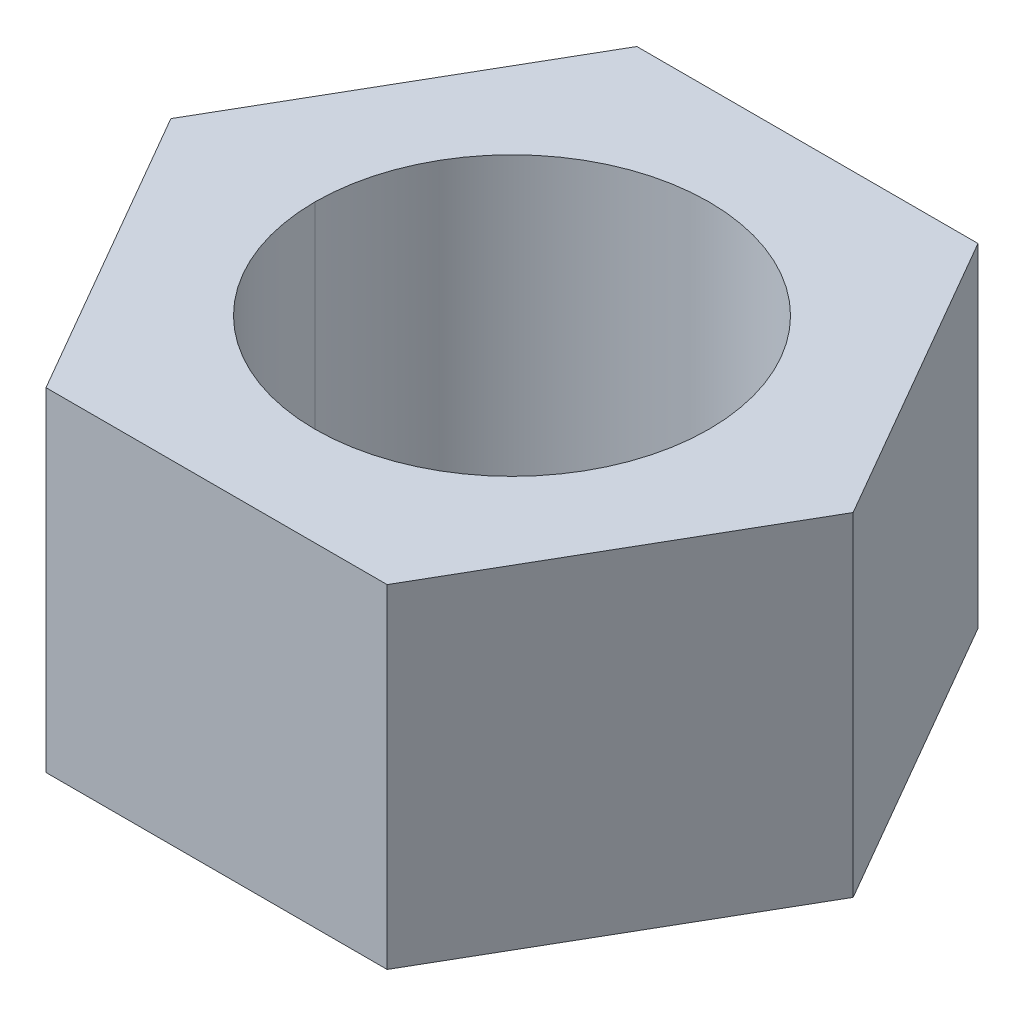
ISO-10303-21;
HEADER;
FILE_DESCRIPTION(('STEP AP214'),'2;1');
FILE_NAME('part.step','',(''),(''),'','','');
FILE_SCHEMA(('AUTOMOTIVE_DESIGN { 1 0 10303 214 1 1 1 1 }'));
ENDSEC;
DATA;
#1=APPLICATION_CONTEXT('core data for automotive mechanical design processes');
#2=APPLICATION_PROTOCOL_DEFINITION('international standard','automotive_design',2000,#1);
#3=PRODUCT_CONTEXT('',#1,'mechanical');
#4=PRODUCT('Part','Part','',(#3));
#5=PRODUCT_RELATED_PRODUCT_CATEGORY('part','',(#4));
#6=PRODUCT_DEFINITION_FORMATION('','',#4);
#7=PRODUCT_DEFINITION_CONTEXT('part definition',#1,'design');
#8=PRODUCT_DEFINITION('design','',#6,#7);
#9=PRODUCT_DEFINITION_SHAPE('','',#8);
#10=(LENGTH_UNIT() NAMED_UNIT(*) SI_UNIT(.MILLI.,.METRE.));
#11=(NAMED_UNIT(*) PLANE_ANGLE_UNIT() SI_UNIT($,.RADIAN.));
#12=(NAMED_UNIT(*) SI_UNIT($,.STERADIAN.) SOLID_ANGLE_UNIT());
#13=UNCERTAINTY_MEASURE_WITH_UNIT(LENGTH_MEASURE(1.E-05),#10,'distance_accuracy_value','');
#14=(GEOMETRIC_REPRESENTATION_CONTEXT(3) GLOBAL_UNCERTAINTY_ASSIGNED_CONTEXT((#13)) GLOBAL_UNIT_ASSIGNED_CONTEXT((#10,
#11,#12)) REPRESENTATION_CONTEXT('',''));
#15=CARTESIAN_POINT('',(0.,0.,0.));
#16=DIRECTION('',(0.,0.,1.));
#17=DIRECTION('',(1.,0.,0.));
#18=AXIS2_PLACEMENT_3D('',#15,#16,#17);
#19=CARTESIAN_POINT('',(10.9985226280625,10.7461538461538,19.05));
#20=DIRECTION('',(0.866025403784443,0.,0.499999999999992));
#21=DIRECTION('',(0.499999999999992,0.,-0.866025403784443));
#22=AXIS2_PLACEMENT_3D('',#19,#20,#21);
#23=PLANE('',#22);
#24=DIRECTION('',(0.499999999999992,0.,-0.866025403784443));
#25=VECTOR('',#24,1.);
#26=CARTESIAN_POINT('',(10.9985226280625,10.7461538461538,19.05));
#27=LINE('',#26,#25);
#28=CARTESIAN_POINT('',(10.9985226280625,10.7461538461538,19.05));
#29=VERTEX_POINT('',#28);
#30=CARTESIAN_POINT('',(21.9970452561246,10.7461538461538,0.));
#31=VERTEX_POINT('',#30);
#32=EDGE_CURVE('E125',#29,#31,#27,.T.);
#33=ORIENTED_EDGE('',*,*,#32,.F.);
#34=DIRECTION('',(0.,1.,0.));
#35=VECTOR('',#34,1.);
#36=CARTESIAN_POINT('',(10.9985226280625,10.7461538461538,19.05));
#37=LINE('',#36,#35);
#38=CARTESIAN_POINT('',(10.9985226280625,-10.7461538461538,19.05));
#39=VERTEX_POINT('',#38);
#40=EDGE_CURVE('E88',#39,#29,#37,.T.);
#41=ORIENTED_EDGE('',*,*,#40,.F.);
#42=DIRECTION('',(0.499999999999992,0.,-0.866025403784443));
#43=VECTOR('',#42,1.);
#44=CARTESIAN_POINT('',(10.9985226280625,-10.7461538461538,19.05));
#45=LINE('',#44,#43);
#46=CARTESIAN_POINT('',(21.9970452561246,-10.7461538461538,0.));
#47=VERTEX_POINT('',#46);
#48=EDGE_CURVE('E99',#39,#47,#45,.T.);
#49=ORIENTED_EDGE('',*,*,#48,.T.);
#50=DIRECTION('',(0.,1.,0.));
#51=VECTOR('',#50,1.);
#52=CARTESIAN_POINT('',(21.9970452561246,10.7461538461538,0.));
#53=LINE('',#52,#51);
#54=EDGE_CURVE('E135',#31,#47,#53,.F.);
#55=ORIENTED_EDGE('',*,*,#54,.F.);
#56=EDGE_LOOP('',(#33,#41,#49,#55));
#57=FACE_BOUND('',#56,.T.);
#58=ADVANCED_FACE('F16',(#57),#23,.T.);
#59=CARTESIAN_POINT('',(21.9970452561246,10.7461538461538,0.));
#60=DIRECTION('',(0.866025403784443,0.,-0.499999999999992));
#61=DIRECTION('',(-0.499999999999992,0.,-0.866025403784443));
#62=AXIS2_PLACEMENT_3D('',#59,#60,#61);
#63=PLANE('',#62);
#64=DIRECTION('',(-0.499999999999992,0.,-0.866025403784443));
#65=VECTOR('',#64,1.);
#66=CARTESIAN_POINT('',(21.9970452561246,10.7461538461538,0.));
#67=LINE('',#66,#65);
#68=CARTESIAN_POINT('',(10.9985226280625,10.7461538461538,-19.05));
#69=VERTEX_POINT('',#68);
#70=EDGE_CURVE('E123',#31,#69,#67,.T.);
#71=ORIENTED_EDGE('',*,*,#70,.F.);
#72=ORIENTED_EDGE('',*,*,#54,.T.);
#73=DIRECTION('',(-0.499999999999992,0.,-0.866025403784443));
#74=VECTOR('',#73,1.);
#75=CARTESIAN_POINT('',(21.9970452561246,-10.7461538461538,0.));
#76=LINE('',#75,#74);
#77=CARTESIAN_POINT('',(10.9985226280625,-10.7461538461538,-19.05));
#78=VERTEX_POINT('',#77);
#79=EDGE_CURVE('E111',#47,#78,#76,.T.);
#80=ORIENTED_EDGE('',*,*,#79,.T.);
#81=DIRECTION('',(0.,1.,0.));
#82=VECTOR('',#81,1.);
#83=CARTESIAN_POINT('',(10.9985226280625,10.7461538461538,-19.05));
#84=LINE('',#83,#82);
#85=EDGE_CURVE('E133',#69,#78,#84,.F.);
#86=ORIENTED_EDGE('',*,*,#85,.F.);
#87=EDGE_LOOP('',(#71,#72,#80,#86));
#88=FACE_BOUND('',#87,.T.);
#89=ADVANCED_FACE('F172',(#88),#63,.T.);
#90=CARTESIAN_POINT('',(10.9985226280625,10.7461538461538,-19.05));
#91=DIRECTION('',(0.,0.,-1.));
#92=DIRECTION('',(-1.,0.,0.));
#93=AXIS2_PLACEMENT_3D('',#90,#91,#92);
#94=PLANE('',#93);
#95=DIRECTION('',(1.,0.,0.));
#96=VECTOR('',#95,1.);
#97=CARTESIAN_POINT('',(0.,10.7461538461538,-19.05));
#98=LINE('',#97,#96);
#99=CARTESIAN_POINT('',(-10.9985226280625,10.7461538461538,-19.05));
#100=VERTEX_POINT('',#99);
#101=EDGE_CURVE('E121',#69,#100,#98,.F.);
#102=ORIENTED_EDGE('',*,*,#101,.F.);
#103=ORIENTED_EDGE('',*,*,#85,.T.);
#104=DIRECTION('',(1.,0.,0.));
#105=VECTOR('',#104,1.);
#106=CARTESIAN_POINT('',(-10.9985226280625,-10.7461538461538,-19.05));
#107=LINE('',#106,#105);
#108=CARTESIAN_POINT('',(-10.9985226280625,-10.7461538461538,-19.05));
#109=VERTEX_POINT('',#108);
#110=EDGE_CURVE('E106',#78,#109,#107,.F.);
#111=ORIENTED_EDGE('',*,*,#110,.T.);
#112=DIRECTION('',(0.,1.,0.));
#113=VECTOR('',#112,1.);
#114=CARTESIAN_POINT('',(-10.9985226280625,10.7461538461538,-19.05));
#115=LINE('',#114,#113);
#116=EDGE_CURVE('E131',#100,#109,#115,.F.);
#117=ORIENTED_EDGE('',*,*,#116,.F.);
#118=EDGE_LOOP('',(#102,#103,#111,#117));
#119=FACE_BOUND('',#118,.T.);
#120=ADVANCED_FACE('F169',(#119),#94,.T.);
#121=CARTESIAN_POINT('',(-10.9985226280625,10.7461538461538,-19.05));
#122=DIRECTION('',(-0.866025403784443,0.,-0.499999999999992));
#123=DIRECTION('',(-0.499999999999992,0.,0.866025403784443));
#124=AXIS2_PLACEMENT_3D('',#121,#122,#123);
#125=PLANE('',#124);
#126=DIRECTION('',(-0.499999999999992,0.,0.866025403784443));
#127=VECTOR('',#126,1.);
#128=CARTESIAN_POINT('',(-10.9985226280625,10.7461538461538,-19.05));
#129=LINE('',#128,#127);
#130=CARTESIAN_POINT('',(-21.9970452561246,10.7461538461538,0.));
#131=VERTEX_POINT('',#130);
#132=EDGE_CURVE('E115',#100,#131,#129,.T.);
#133=ORIENTED_EDGE('',*,*,#132,.F.);
#134=ORIENTED_EDGE('',*,*,#116,.T.);
#135=DIRECTION('',(-0.499999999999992,0.,0.866025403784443));
#136=VECTOR('',#135,1.);
#137=CARTESIAN_POINT('',(-10.9985226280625,-10.7461538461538,-19.05));
#138=LINE('',#137,#136);
#139=CARTESIAN_POINT('',(-21.9970452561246,-10.7461538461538,0.));
#140=VERTEX_POINT('',#139);
#141=EDGE_CURVE('E104',#109,#140,#138,.T.);
#142=ORIENTED_EDGE('',*,*,#141,.T.);
#143=DIRECTION('',(0.,1.,0.));
#144=VECTOR('',#143,1.);
#145=CARTESIAN_POINT('',(-21.9970452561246,10.7461538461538,0.));
#146=LINE('',#145,#144);
#147=EDGE_CURVE('E103',#131,#140,#146,.F.);
#148=ORIENTED_EDGE('',*,*,#147,.F.);
#149=EDGE_LOOP('',(#133,#134,#142,#148));
#150=FACE_BOUND('',#149,.T.);
#151=ADVANCED_FACE('F166',(#150),#125,.T.);
#152=CARTESIAN_POINT('',(-21.9970452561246,10.7461538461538,0.));
#153=DIRECTION('',(-0.866025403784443,0.,0.499999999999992));
#154=DIRECTION('',(0.499999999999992,0.,0.866025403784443));
#155=AXIS2_PLACEMENT_3D('',#152,#153,#154);
#156=PLANE('',#155);
#157=DIRECTION('',(0.499999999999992,0.,0.866025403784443));
#158=VECTOR('',#157,1.);
#159=CARTESIAN_POINT('',(-21.9970452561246,10.7461538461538,0.));
#160=LINE('',#159,#158);
#161=CARTESIAN_POINT('',(-10.9985226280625,10.7461538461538,19.05));
#162=VERTEX_POINT('',#161);
#163=EDGE_CURVE('E87',#131,#162,#160,.T.);
#164=ORIENTED_EDGE('',*,*,#163,.F.);
#165=ORIENTED_EDGE('',*,*,#147,.T.);
#166=DIRECTION('',(0.499999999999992,0.,0.866025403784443));
#167=VECTOR('',#166,1.);
#168=CARTESIAN_POINT('',(-21.9970452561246,-10.7461538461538,0.));
#169=LINE('',#168,#167);
#170=CARTESIAN_POINT('',(-10.9985226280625,-10.7461538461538,19.05));
#171=VERTEX_POINT('',#170);
#172=EDGE_CURVE('E95',#140,#171,#169,.T.);
#173=ORIENTED_EDGE('',*,*,#172,.T.);
#174=DIRECTION('',(0.,1.,0.));
#175=VECTOR('',#174,1.);
#176=CARTESIAN_POINT('',(-10.9985226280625,10.7461538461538,19.05));
#177=LINE('',#176,#175);
#178=EDGE_CURVE('E78',#162,#171,#177,.F.);
#179=ORIENTED_EDGE('',*,*,#178,.F.);
#180=EDGE_LOOP('',(#164,#165,#173,#179));
#181=FACE_BOUND('',#180,.T.);
#182=ADVANCED_FACE('F102',(#181),#156,.T.);
#183=CARTESIAN_POINT('',(-10.9985226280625,10.7461538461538,19.05));
#184=DIRECTION('',(0.,0.,1.));
#185=DIRECTION('',(1.,0.,0.));
#186=AXIS2_PLACEMENT_3D('',#183,#184,#185);
#187=PLANE('',#186);
#188=DIRECTION('',(1.,0.,0.));
#189=VECTOR('',#188,1.);
#190=CARTESIAN_POINT('',(0.,10.7461538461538,19.05));
#191=LINE('',#190,#189);
#192=EDGE_CURVE('E83',#162,#29,#191,.T.);
#193=ORIENTED_EDGE('',*,*,#192,.F.);
#194=ORIENTED_EDGE('',*,*,#178,.T.);
#195=DIRECTION('',(1.,0.,0.));
#196=VECTOR('',#195,1.);
#197=CARTESIAN_POINT('',(-10.9985226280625,-10.7461538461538,19.05));
#198=LINE('',#197,#196);
#199=EDGE_CURVE('E81',#171,#39,#198,.T.);
#200=ORIENTED_EDGE('',*,*,#199,.T.);
#201=ORIENTED_EDGE('',*,*,#40,.T.);
#202=EDGE_LOOP('',(#193,#194,#200,#201));
#203=FACE_BOUND('',#202,.T.);
#204=ADVANCED_FACE('F80',(#203),#187,.T.);
#205=CARTESIAN_POINT('',(0.,10.7461538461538,0.));
#206=DIRECTION('',(0.,1.,0.));
#207=DIRECTION('',(0.,0.,1.));
#208=AXIS2_PLACEMENT_3D('',#205,#206,#207);
#209=PLANE('',#208);
#210=ORIENTED_EDGE('',*,*,#101,.T.);
#211=ORIENTED_EDGE('',*,*,#132,.T.);
#212=ORIENTED_EDGE('',*,*,#163,.T.);
#213=ORIENTED_EDGE('',*,*,#192,.T.);
#214=ORIENTED_EDGE('',*,*,#32,.T.);
#215=ORIENTED_EDGE('',*,*,#70,.T.);
#216=EDGE_LOOP('',(#210,#211,#212,#213,#214,#215));
#217=FACE_BOUND('',#216,.T.);
#218=CARTESIAN_POINT('',(0.,10.7461538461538,0.));
#219=DIRECTION('',(0.,-1.,0.));
#220=DIRECTION('',(0.,0.,-1.));
#221=AXIS2_PLACEMENT_3D('',#218,#219,#220);
#222=CIRCLE('',#221,12.7);
#223=CARTESIAN_POINT('',(12.7,10.7461538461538,0.));
#224=VERTEX_POINT('',#223);
#225=CARTESIAN_POINT('',(-12.7,10.7461538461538,0.));
#226=VERTEX_POINT('',#225);
#227=EDGE_CURVE('E117',#224,#226,#222,.T.);
#228=ORIENTED_EDGE('',*,*,#227,.T.);
#229=CARTESIAN_POINT('',(0.,10.7461538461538,0.));
#230=DIRECTION('',(0.,-1.,0.));
#231=DIRECTION('',(0.,0.,-1.));
#232=AXIS2_PLACEMENT_3D('',#229,#230,#231);
#233=CIRCLE('',#232,12.7);
#234=EDGE_CURVE('E140',#226,#224,#233,.T.);
#235=ORIENTED_EDGE('',*,*,#234,.T.);
#236=EDGE_LOOP('',(#228,#235));
#237=FACE_BOUND('',#236,.T.);
#238=ADVANCED_FACE('F156',(#217,#237),#209,.T.);
#239=CARTESIAN_POINT('',(-10.9985226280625,-10.7461538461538,19.05));
#240=DIRECTION('',(0.,1.,0.));
#241=DIRECTION('',(0.,0.,1.));
#242=AXIS2_PLACEMENT_3D('',#239,#240,#241);
#243=PLANE('',#242);
#244=ORIENTED_EDGE('',*,*,#172,.F.);
#245=ORIENTED_EDGE('',*,*,#141,.F.);
#246=ORIENTED_EDGE('',*,*,#110,.F.);
#247=ORIENTED_EDGE('',*,*,#79,.F.);
#248=ORIENTED_EDGE('',*,*,#48,.F.);
#249=ORIENTED_EDGE('',*,*,#199,.F.);
#250=EDGE_LOOP('',(#244,#245,#246,#247,#248,#249));
#251=FACE_BOUND('',#250,.T.);
#252=CARTESIAN_POINT('',(0.,-10.7461538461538,0.));
#253=DIRECTION('',(0.,-1.,0.));
#254=DIRECTION('',(0.,0.,-1.));
#255=AXIS2_PLACEMENT_3D('',#252,#253,#254);
#256=CIRCLE('',#255,12.7);
#257=CARTESIAN_POINT('',(12.7,-10.7461538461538,0.));
#258=VERTEX_POINT('',#257);
#259=CARTESIAN_POINT('',(-12.7,-10.7461538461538,0.));
#260=VERTEX_POINT('',#259);
#261=EDGE_CURVE('E19',#258,#260,#256,.F.);
#262=ORIENTED_EDGE('',*,*,#261,.T.);
#263=CARTESIAN_POINT('',(0.,-10.7461538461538,0.));
#264=DIRECTION('',(0.,-1.,0.));
#265=DIRECTION('',(0.,0.,-1.));
#266=AXIS2_PLACEMENT_3D('',#263,#264,#265);
#267=CIRCLE('',#266,12.7);
#268=EDGE_CURVE('E25',#260,#258,#267,.F.);
#269=ORIENTED_EDGE('',*,*,#268,.T.);
#270=EDGE_LOOP('',(#262,#269));
#271=FACE_BOUND('',#270,.T.);
#272=ADVANCED_FACE('F92',(#251,#271),#243,.F.);
#273=CARTESIAN_POINT('',(0.,-1.95384615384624,0.));
#274=DIRECTION('',(0.,-1.,0.));
#275=DIRECTION('',(0.,0.,-1.));
#276=AXIS2_PLACEMENT_3D('',#273,#274,#275);
#277=CYLINDRICAL_SURFACE('',#276,12.7);
#278=ORIENTED_EDGE('',*,*,#234,.F.);
#279=DIRECTION('',(0.,-1.,0.));
#280=VECTOR('',#279,1.);
#281=CARTESIAN_POINT('',(-12.7,-1.95384615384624,0.));
#282=LINE('',#281,#280);
#283=EDGE_CURVE('E116',#226,#260,#282,.T.);
#284=ORIENTED_EDGE('',*,*,#283,.T.);
#285=ORIENTED_EDGE('',*,*,#261,.F.);
#286=DIRECTION('',(0.,-1.,0.));
#287=VECTOR('',#286,1.);
#288=CARTESIAN_POINT('',(12.7,-1.95384615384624,0.));
#289=LINE('',#288,#287);
#290=EDGE_CURVE('E11',#258,#224,#289,.F.);
#291=ORIENTED_EDGE('',*,*,#290,.T.);
#292=EDGE_LOOP('',(#278,#284,#285,#291));
#293=FACE_BOUND('',#292,.T.);
#294=ADVANCED_FACE('F147',(#293),#277,.F.);
#295=CARTESIAN_POINT('',(0.,-1.95384615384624,0.));
#296=DIRECTION('',(0.,-1.,0.));
#297=DIRECTION('',(0.,0.,-1.));
#298=AXIS2_PLACEMENT_3D('',#295,#296,#297);
#299=CYLINDRICAL_SURFACE('',#298,12.7);
#300=ORIENTED_EDGE('',*,*,#268,.F.);
#301=ORIENTED_EDGE('',*,*,#283,.F.);
#302=ORIENTED_EDGE('',*,*,#227,.F.);
#303=ORIENTED_EDGE('',*,*,#290,.F.);
#304=EDGE_LOOP('',(#300,#301,#302,#303));
#305=FACE_BOUND('',#304,.T.);
#306=ADVANCED_FACE('F146',(#305),#299,.F.);
#307=CLOSED_SHELL('',(#58,#89,#120,#151,#182,#204,#238,#272,#294,#306));
#308=MANIFOLD_SOLID_BREP('B1',#307);
#309=ADVANCED_BREP_SHAPE_REPRESENTATION('',(#18,#308),#14);
#310=SHAPE_DEFINITION_REPRESENTATION(#9,#309);
ENDSEC;
END-ISO-10303-21;
